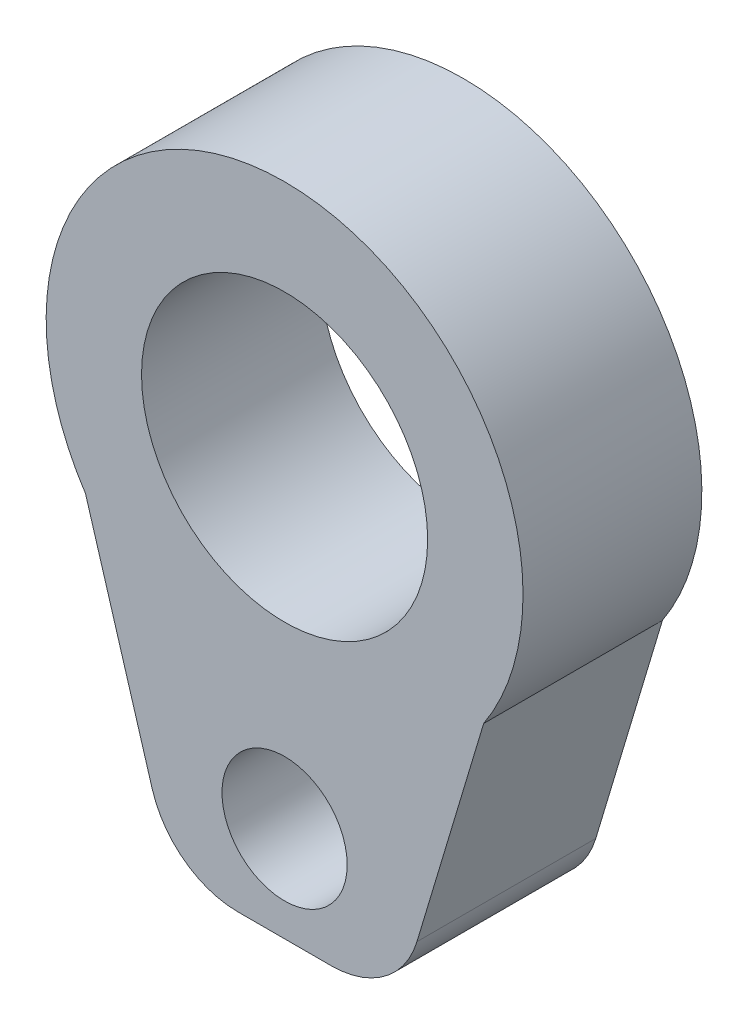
ISO-10303-21;
HEADER;
FILE_DESCRIPTION(('STEP AP214'),'2;1');
FILE_NAME('part.step','',(''),(''),'','','');
FILE_SCHEMA(('AUTOMOTIVE_DESIGN { 1 0 10303 214 1 1 1 1 }'));
ENDSEC;
DATA;
#1=APPLICATION_CONTEXT('core data for automotive mechanical design processes');
#2=APPLICATION_PROTOCOL_DEFINITION('international standard','automotive_design',2000,#1);
#3=PRODUCT_CONTEXT('',#1,'mechanical');
#4=PRODUCT('Part','Part','',(#3));
#5=PRODUCT_RELATED_PRODUCT_CATEGORY('part','',(#4));
#6=PRODUCT_DEFINITION_FORMATION('','',#4);
#7=PRODUCT_DEFINITION_CONTEXT('part definition',#1,'design');
#8=PRODUCT_DEFINITION('design','',#6,#7);
#9=PRODUCT_DEFINITION_SHAPE('','',#8);
#10=(LENGTH_UNIT() NAMED_UNIT(*) SI_UNIT(.MILLI.,.METRE.));
#11=(NAMED_UNIT(*) PLANE_ANGLE_UNIT() SI_UNIT($,.RADIAN.));
#12=(NAMED_UNIT(*) SI_UNIT($,.STERADIAN.) SOLID_ANGLE_UNIT());
#13=UNCERTAINTY_MEASURE_WITH_UNIT(LENGTH_MEASURE(1.E-05),#10,'distance_accuracy_value','');
#14=(GEOMETRIC_REPRESENTATION_CONTEXT(3) GLOBAL_UNCERTAINTY_ASSIGNED_CONTEXT((#13)) GLOBAL_UNIT_ASSIGNED_CONTEXT((#10,
#11,#12)) REPRESENTATION_CONTEXT('',''));
#15=CARTESIAN_POINT('',(0.,0.,0.));
#16=DIRECTION('',(0.,0.,1.));
#17=DIRECTION('',(1.,0.,0.));
#18=AXIS2_PLACEMENT_3D('',#15,#16,#17);
#19=CARTESIAN_POINT('',(0.,0.,3.));
#20=DIRECTION('',(0.,0.,-1.));
#21=DIRECTION('',(-1.,0.,0.));
#22=AXIS2_PLACEMENT_3D('',#19,#20,#21);
#23=CYLINDRICAL_SURFACE('',#22,4.);
#24=CARTESIAN_POINT('',(0.,0.,3.));
#25=DIRECTION('',(0.,0.,1.));
#26=DIRECTION('',(1.,0.,0.));
#27=AXIS2_PLACEMENT_3D('',#24,#25,#26);
#28=CIRCLE('',#27,4.);
#29=CARTESIAN_POINT('',(3.33944954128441,-2.20183486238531,3.));
#30=VERTEX_POINT('',#29);
#31=CARTESIAN_POINT('',(-3.33944954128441,-2.20183486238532,3.));
#32=VERTEX_POINT('',#31);
#33=EDGE_CURVE('E103',#30,#32,#28,.T.);
#34=ORIENTED_EDGE('',*,*,#33,.F.);
#35=DIRECTION('',(0.,0.,-1.));
#36=VECTOR('',#35,1.);
#37=CARTESIAN_POINT('',(3.33944954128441,-2.20183486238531,3.));
#38=LINE('',#37,#36);
#39=CARTESIAN_POINT('',(3.33944954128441,-2.20183486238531,0.));
#40=VERTEX_POINT('',#39);
#41=EDGE_CURVE('E106',#30,#40,#38,.T.);
#42=ORIENTED_EDGE('',*,*,#41,.T.);
#43=CARTESIAN_POINT('',(0.,0.,0.));
#44=DIRECTION('',(0.,0.,1.));
#45=DIRECTION('',(1.,0.,0.));
#46=AXIS2_PLACEMENT_3D('',#43,#44,#45);
#47=CIRCLE('',#46,4.);
#48=CARTESIAN_POINT('',(-3.3394495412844,-2.20183486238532,0.));
#49=VERTEX_POINT('',#48);
#50=EDGE_CURVE('E111',#40,#49,#47,.T.);
#51=ORIENTED_EDGE('',*,*,#50,.T.);
#52=DIRECTION('',(0.,0.,-1.));
#53=VECTOR('',#52,1.);
#54=CARTESIAN_POINT('',(-3.3394495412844,-2.20183486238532,3.));
#55=LINE('',#54,#53);
#56=EDGE_CURVE('E108',#49,#32,#55,.F.);
#57=ORIENTED_EDGE('',*,*,#56,.T.);
#58=EDGE_LOOP('',(#34,#42,#51,#57));
#59=FACE_BOUND('',#58,.T.);
#60=ADVANCED_FACE('F45',(#59),#23,.T.);
#61=CARTESIAN_POINT('',(0.,0.,3.));
#62=DIRECTION('',(0.,0.,1.));
#63=DIRECTION('',(1.,0.,0.));
#64=AXIS2_PLACEMENT_3D('',#61,#62,#63);
#65=PLANE('',#64);
#66=CARTESIAN_POINT('',(0.,-5.4,3.));
#67=DIRECTION('',(0.,0.,1.));
#68=DIRECTION('',(1.,0.,0.));
#69=AXIS2_PLACEMENT_3D('',#66,#67,#68);
#70=CIRCLE('',#69,1.05);
#71=CARTESIAN_POINT('',(1.05,-5.4,3.));
#72=VERTEX_POINT('',#71);
#73=EDGE_CURVE('E188',#72,#72,#70,.T.);
#74=ORIENTED_EDGE('',*,*,#73,.F.);
#75=EDGE_LOOP('',(#74));
#76=FACE_BOUND('',#75,.T.);
#77=CARTESIAN_POINT('',(0.,0.,3.));
#78=DIRECTION('',(0.,0.,1.));
#79=DIRECTION('',(1.,0.,0.));
#80=AXIS2_PLACEMENT_3D('',#77,#78,#79);
#81=CIRCLE('',#80,2.4);
#82=CARTESIAN_POINT('',(2.4,0.,3.));
#83=VERTEX_POINT('',#82);
#84=EDGE_CURVE('E173',#83,#83,#81,.F.);
#85=ORIENTED_EDGE('',*,*,#84,.T.);
#86=EDGE_LOOP('',(#85));
#87=FACE_BOUND('',#86,.T.);
#88=DIRECTION('',(-0.287347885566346,0.957826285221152,0.));
#89=VECTOR('',#88,1.);
#90=CARTESIAN_POINT('',(-1.9,-7.,3.));
#91=LINE('',#90,#89);
#92=CARTESIAN_POINT('',(-2.22069345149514,-5.93102182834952,3.));
#93=VERTEX_POINT('',#92);
#94=EDGE_CURVE('E124',#93,#32,#91,.T.);
#95=ORIENTED_EDGE('',*,*,#94,.F.);
#96=CARTESIAN_POINT('',(-0.783954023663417,-5.5,3.));
#97=DIRECTION('',(0.,0.,1.));
#98=DIRECTION('',(1.,0.,0.));
#99=AXIS2_PLACEMENT_3D('',#96,#97,#98);
#100=CIRCLE('',#99,1.5);
#101=CARTESIAN_POINT('',(-0.783954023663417,-7.,3.));
#102=VERTEX_POINT('',#101);
#103=EDGE_CURVE('E54',#93,#102,#100,.T.);
#104=ORIENTED_EDGE('',*,*,#103,.T.);
#105=DIRECTION('',(-1.,0.,0.));
#106=VECTOR('',#105,1.);
#107=CARTESIAN_POINT('',(1.9,-7.,3.));
#108=LINE('',#107,#106);
#109=CARTESIAN_POINT('',(0.783954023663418,-7.,3.));
#110=VERTEX_POINT('',#109);
#111=EDGE_CURVE('E127',#110,#102,#108,.T.);
#112=ORIENTED_EDGE('',*,*,#111,.F.);
#113=CARTESIAN_POINT('',(0.783954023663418,-5.5,3.));
#114=DIRECTION('',(0.,0.,1.));
#115=DIRECTION('',(1.,0.,0.));
#116=AXIS2_PLACEMENT_3D('',#113,#114,#115);
#117=CIRCLE('',#116,1.5);
#118=CARTESIAN_POINT('',(2.22069345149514,-5.93102182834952,3.));
#119=VERTEX_POINT('',#118);
#120=EDGE_CURVE('E61',#110,#119,#117,.T.);
#121=ORIENTED_EDGE('',*,*,#120,.T.);
#122=DIRECTION('',(-0.287347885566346,-0.957826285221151,0.));
#123=VECTOR('',#122,1.);
#124=CARTESIAN_POINT('',(4.,0.,3.));
#125=LINE('',#124,#123);
#126=EDGE_CURVE('E116',#30,#119,#125,.T.);
#127=ORIENTED_EDGE('',*,*,#126,.F.);
#128=ORIENTED_EDGE('',*,*,#33,.T.);
#129=EDGE_LOOP('',(#95,#104,#112,#121,#127,#128));
#130=FACE_BOUND('',#129,.T.);
#131=ADVANCED_FACE('F122',(#76,#87,#130),#65,.T.);
#132=CARTESIAN_POINT('',(0.,0.,0.));
#133=DIRECTION('',(0.,0.,1.));
#134=DIRECTION('',(1.,0.,0.));
#135=AXIS2_PLACEMENT_3D('',#132,#133,#134);
#136=PLANE('',#135);
#137=CARTESIAN_POINT('',(0.,-5.4,0.));
#138=DIRECTION('',(0.,0.,1.));
#139=DIRECTION('',(1.,0.,0.));
#140=AXIS2_PLACEMENT_3D('',#137,#138,#139);
#141=CIRCLE('',#140,1.05);
#142=CARTESIAN_POINT('',(1.05,-5.4,0.));
#143=VERTEX_POINT('',#142);
#144=EDGE_CURVE('E183',#143,#143,#141,.F.);
#145=ORIENTED_EDGE('',*,*,#144,.F.);
#146=EDGE_LOOP('',(#145));
#147=FACE_BOUND('',#146,.T.);
#148=CARTESIAN_POINT('',(0.,0.,0.));
#149=DIRECTION('',(0.,0.,-1.));
#150=DIRECTION('',(-1.,0.,0.));
#151=AXIS2_PLACEMENT_3D('',#148,#149,#150);
#152=CIRCLE('',#151,2.4);
#153=CARTESIAN_POINT('',(-2.4,0.,0.));
#154=VERTEX_POINT('',#153);
#155=EDGE_CURVE('E178',#154,#154,#152,.T.);
#156=ORIENTED_EDGE('',*,*,#155,.F.);
#157=EDGE_LOOP('',(#156));
#158=FACE_BOUND('',#157,.T.);
#159=DIRECTION('',(-1.,0.,0.));
#160=VECTOR('',#159,1.);
#161=CARTESIAN_POINT('',(1.9,-7.,0.));
#162=LINE('',#161,#160);
#163=CARTESIAN_POINT('',(0.783954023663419,-7.,0.));
#164=VERTEX_POINT('',#163);
#165=CARTESIAN_POINT('',(-0.783954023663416,-7.,0.));
#166=VERTEX_POINT('',#165);
#167=EDGE_CURVE('E166',#164,#166,#162,.T.);
#168=ORIENTED_EDGE('',*,*,#167,.T.);
#169=CARTESIAN_POINT('',(-0.783954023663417,-5.5,0.));
#170=DIRECTION('',(0.,0.,1.));
#171=DIRECTION('',(1.,0.,0.));
#172=AXIS2_PLACEMENT_3D('',#169,#170,#171);
#173=CIRCLE('',#172,1.5);
#174=CARTESIAN_POINT('',(-2.22069345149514,-5.93102182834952,0.));
#175=VERTEX_POINT('',#174);
#176=EDGE_CURVE('E145',#166,#175,#173,.F.);
#177=ORIENTED_EDGE('',*,*,#176,.T.);
#178=DIRECTION('',(-0.287347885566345,0.957826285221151,0.));
#179=VECTOR('',#178,1.);
#180=CARTESIAN_POINT('',(-1.9,-7.,0.));
#181=LINE('',#180,#179);
#182=EDGE_CURVE('E162',#175,#49,#181,.T.);
#183=ORIENTED_EDGE('',*,*,#182,.T.);
#184=ORIENTED_EDGE('',*,*,#50,.F.);
#185=DIRECTION('',(-0.287347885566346,-0.957826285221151,0.));
#186=VECTOR('',#185,1.);
#187=CARTESIAN_POINT('',(4.,0.,0.));
#188=LINE('',#187,#186);
#189=CARTESIAN_POINT('',(2.22069345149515,-5.93102182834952,0.));
#190=VERTEX_POINT('',#189);
#191=EDGE_CURVE('E119',#40,#190,#188,.T.);
#192=ORIENTED_EDGE('',*,*,#191,.T.);
#193=CARTESIAN_POINT('',(0.783954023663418,-5.5,0.));
#194=DIRECTION('',(0.,0.,1.));
#195=DIRECTION('',(1.,0.,0.));
#196=AXIS2_PLACEMENT_3D('',#193,#194,#195);
#197=CIRCLE('',#196,1.5);
#198=EDGE_CURVE('E142',#190,#164,#197,.F.);
#199=ORIENTED_EDGE('',*,*,#198,.T.);
#200=EDGE_LOOP('',(#168,#177,#183,#184,#192,#199));
#201=FACE_BOUND('',#200,.T.);
#202=ADVANCED_FACE('F165',(#147,#158,#201),#136,.F.);
#203=CARTESIAN_POINT('',(-1.9,-7.,13.6301458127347));
#204=DIRECTION('',(-0.957826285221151,-0.287347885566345,0.));
#205=DIRECTION('',(0.287347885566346,-0.957826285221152,0.));
#206=AXIS2_PLACEMENT_3D('',#203,#204,#205);
#207=PLANE('',#206);
#208=ORIENTED_EDGE('',*,*,#182,.F.);
#209=DIRECTION('',(0.,0.,-1.));
#210=VECTOR('',#209,1.);
#211=CARTESIAN_POINT('',(-2.22069345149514,-5.93102182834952,13.6301458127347));
#212=LINE('',#211,#210);
#213=EDGE_CURVE('E69',#175,#93,#212,.F.);
#214=ORIENTED_EDGE('',*,*,#213,.T.);
#215=ORIENTED_EDGE('',*,*,#94,.T.);
#216=ORIENTED_EDGE('',*,*,#56,.F.);
#217=EDGE_LOOP('',(#208,#214,#215,#216));
#218=FACE_BOUND('',#217,.T.);
#219=ADVANCED_FACE('F167',(#218),#207,.T.);
#220=CARTESIAN_POINT('',(4.,0.,13.6301458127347));
#221=DIRECTION('',(0.957826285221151,-0.287347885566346,0.));
#222=DIRECTION('',(0.287347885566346,0.957826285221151,0.));
#223=AXIS2_PLACEMENT_3D('',#220,#221,#222);
#224=PLANE('',#223);
#225=ORIENTED_EDGE('',*,*,#126,.T.);
#226=DIRECTION('',(0.,0.,-1.));
#227=VECTOR('',#226,1.);
#228=CARTESIAN_POINT('',(2.22069345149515,-5.93102182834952,13.6301458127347));
#229=LINE('',#228,#227);
#230=EDGE_CURVE('E11',#119,#190,#229,.T.);
#231=ORIENTED_EDGE('',*,*,#230,.T.);
#232=ORIENTED_EDGE('',*,*,#191,.F.);
#233=ORIENTED_EDGE('',*,*,#41,.F.);
#234=EDGE_LOOP('',(#225,#231,#232,#233));
#235=FACE_BOUND('',#234,.T.);
#236=ADVANCED_FACE('F115',(#235),#224,.T.);
#237=CARTESIAN_POINT('',(1.9,-7.,13.6301458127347));
#238=DIRECTION('',(0.,-1.,0.));
#239=DIRECTION('',(0.,0.,-1.));
#240=AXIS2_PLACEMENT_3D('',#237,#238,#239);
#241=PLANE('',#240);
#242=ORIENTED_EDGE('',*,*,#111,.T.);
#243=DIRECTION('',(0.,0.,-1.));
#244=VECTOR('',#243,1.);
#245=CARTESIAN_POINT('',(-0.783954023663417,-7.,13.6301458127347));
#246=LINE('',#245,#244);
#247=EDGE_CURVE('E138',#102,#166,#246,.T.);
#248=ORIENTED_EDGE('',*,*,#247,.T.);
#249=ORIENTED_EDGE('',*,*,#167,.F.);
#250=DIRECTION('',(0.,0.,-1.));
#251=VECTOR('',#250,1.);
#252=CARTESIAN_POINT('',(0.783954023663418,-7.,13.6301458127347));
#253=LINE('',#252,#251);
#254=EDGE_CURVE('E110',#164,#110,#253,.F.);
#255=ORIENTED_EDGE('',*,*,#254,.T.);
#256=EDGE_LOOP('',(#242,#248,#249,#255));
#257=FACE_BOUND('',#256,.T.);
#258=ADVANCED_FACE('F157',(#257),#241,.T.);
#259=CARTESIAN_POINT('',(0.,0.,9.78822509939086));
#260=DIRECTION('',(0.,0.,-1.));
#261=DIRECTION('',(-1.,0.,0.));
#262=AXIS2_PLACEMENT_3D('',#259,#260,#261);
#263=CYLINDRICAL_SURFACE('',#262,2.4);
#264=ORIENTED_EDGE('',*,*,#155,.T.);
#265=EDGE_LOOP('',(#264));
#266=FACE_BOUND('',#265,.T.);
#267=ORIENTED_EDGE('',*,*,#84,.F.);
#268=EDGE_LOOP('',(#267));
#269=FACE_BOUND('',#268,.T.);
#270=ADVANCED_FACE('F210',(#266,#269),#263,.F.);
#271=CARTESIAN_POINT('',(-0.783954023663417,-5.5,13.6301458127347));
#272=DIRECTION('',(0.,0.,-1.));
#273=DIRECTION('',(-1.,0.,0.));
#274=AXIS2_PLACEMENT_3D('',#271,#272,#273);
#275=CYLINDRICAL_SURFACE('',#274,1.5);
#276=ORIENTED_EDGE('',*,*,#103,.F.);
#277=ORIENTED_EDGE('',*,*,#213,.F.);
#278=ORIENTED_EDGE('',*,*,#176,.F.);
#279=ORIENTED_EDGE('',*,*,#247,.F.);
#280=EDGE_LOOP('',(#276,#277,#278,#279));
#281=FACE_BOUND('',#280,.T.);
#282=ADVANCED_FACE('F163',(#281),#275,.T.);
#283=CARTESIAN_POINT('',(0.783954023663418,-5.5,13.6301458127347));
#284=DIRECTION('',(0.,0.,-1.));
#285=DIRECTION('',(-1.,0.,0.));
#286=AXIS2_PLACEMENT_3D('',#283,#284,#285);
#287=CYLINDRICAL_SURFACE('',#286,1.5);
#288=ORIENTED_EDGE('',*,*,#120,.F.);
#289=ORIENTED_EDGE('',*,*,#254,.F.);
#290=ORIENTED_EDGE('',*,*,#198,.F.);
#291=ORIENTED_EDGE('',*,*,#230,.F.);
#292=EDGE_LOOP('',(#288,#289,#290,#291));
#293=FACE_BOUND('',#292,.T.);
#294=ADVANCED_FACE('F47',(#293),#287,.T.);
#295=CARTESIAN_POINT('',(0.,-5.4,-2.9698484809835));
#296=DIRECTION('',(0.,0.,1.));
#297=DIRECTION('',(1.,0.,0.));
#298=AXIS2_PLACEMENT_3D('',#295,#296,#297);
#299=CYLINDRICAL_SURFACE('',#298,1.05);
#300=ORIENTED_EDGE('',*,*,#144,.T.);
#301=EDGE_LOOP('',(#300));
#302=FACE_BOUND('',#301,.T.);
#303=ORIENTED_EDGE('',*,*,#73,.T.);
#304=EDGE_LOOP('',(#303));
#305=FACE_BOUND('',#304,.T.);
#306=ADVANCED_FACE('F195',(#302,#305),#299,.F.);
#307=CLOSED_SHELL('',(#60,#131,#202,#219,#236,#258,#270,#282,#294,#306));
#308=MANIFOLD_SOLID_BREP('B2',#307);
#309=ADVANCED_BREP_SHAPE_REPRESENTATION('',(#18,#308),#14);
#310=SHAPE_DEFINITION_REPRESENTATION(#9,#309);
ENDSEC;
END-ISO-10303-21;
